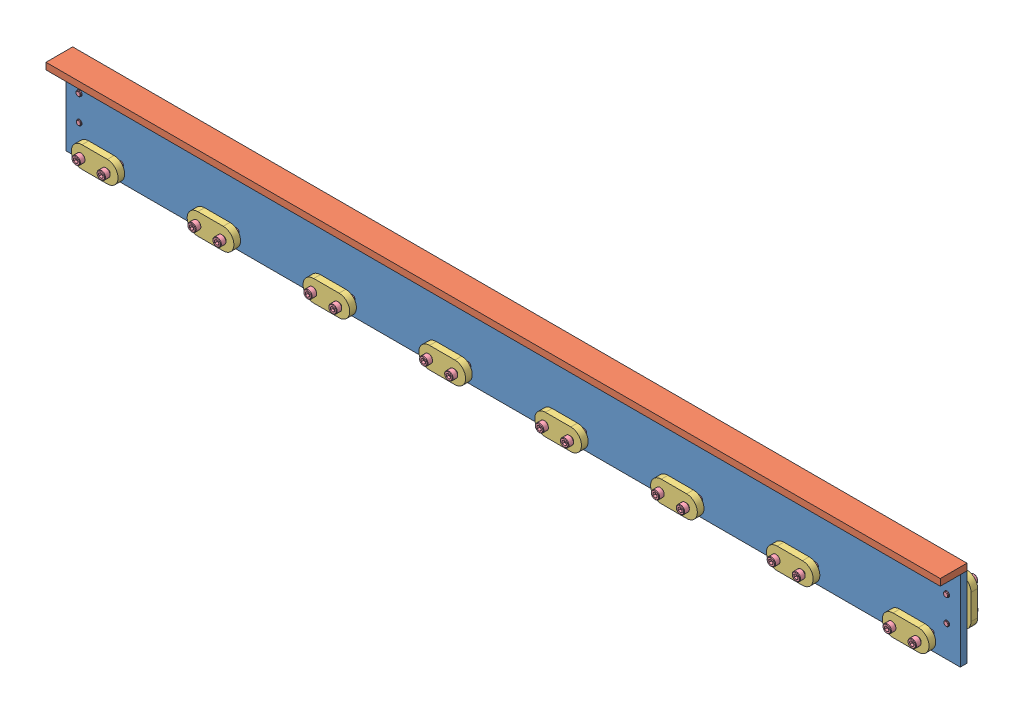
SolidWorks assembly fs-bs-right-mount-assembly-with-screws.SLDASM, configuration Default (file format 9000). Lengths in mm.
Overall size (850.9 82.55 45.12).
33 component instances, 4 part files, 6 mates.
Components (placement in the parent):
- fs-bs-right-mount-assembly-1: fs-bs-right-mount-assembly.SLDASM [Default] at origin size (850.9 82.55 38.15)
  - fs-bs-right-mount-vertical-component-1: fs-bs-right-mount-vertical-component.SLDPRT [Default] at origin size (850.9 76.2 6.35)
  - fs-bs-right-mount-horizontal-component-1: fs-bs-right-mount-horizontal-component.SLDPRT [Default] at (425.45 76.2 12.7) size (850.9 6.35 25.4)
  - fs-clamp-1: fs-clamp.SLDPRT [Default] at (27.94 15.24 12.7326) size (44.45 20.32 6.35)
  - fs-clamp-11: fs-clamp.SLDPRT [Default] at (12.7 29.845 -12.7409) x (0 1 0) z (0 0 1) size (44.45 20.32 6.35)
  - fs-clamp-12: fs-clamp.SLDPRT [Default] at (838.2 29.845 -6.3972) x (0 1 0) z (0 0 -1) size (44.45 20.32 6.35)
  - fs-clamp-4: fs-clamp.SLDPRT [Default] at (138.176 15.24 12.7326) size (44.45 20.32 6.35)
  - fs-clamp-5: fs-clamp.SLDPRT [Default] at (248.412 15.24 12.7326) size (44.45 20.32 6.35)
  - fs-clamp-6: fs-clamp.SLDPRT [Default] at (358.648 15.24 12.7326) size (44.45 20.32 6.35)
  - fs-clamp-7: fs-clamp.SLDPRT [Default] at (468.884 15.24 12.7326) size (44.45 20.32 6.35)
  - fs-clamp-8: fs-clamp.SLDPRT [Default] at (579.12 15.24 12.7326) size (44.45 20.32 6.35)
  - fs-clamp-9: fs-clamp.SLDPRT [Default] at (689.356 15.24 12.7326) size (44.45 20.32 6.35)
  - fs-clamp-10: fs-clamp.SLDPRT [Default] at (799.592 15.24 12.7326) size (44.45 20.32 6.35)
- socket head cap screw_ai-1: socket head cap screw_ai.sldprt [HX-SHCS 0.19-32x0.875x0.875-N] at (52.07 15.24 25.3347) x (0 0 -1) z (0.61191 -0.790927 0) size (27.05 7.94 7.94)
- socket head cap screw_ai-2: socket head cap screw_ai.sldprt [HX-SHCS 0.19-32x0.875x0.875-N] at (12.7 29.845 -19.6757) x (0 0 1) z (-0.841681 -0.539975 0) size (27.05 7.94 7.94)
- socket head cap screw_ai-3: socket head cap screw_ai.sldprt [HX-SHCS 0.19-32x0.875x0.875-N] at (12.7 53.975 -19.387) x (0 0 1) z (0.231262 0.972891 0) size (27.05 7.94 7.94)
- socket head cap screw_ai-4: socket head cap screw_ai.sldprt [HX-SHCS 0.19-32x0.875x0.875-N] at (838.2 29.845 -19.7235) x (0 0 1) z (-0.178736 -0.983897 0) size (27.05 7.94 7.94)
- socket head cap screw_ai-5: socket head cap screw_ai.sldprt [HX-SHCS 0.19-32x0.875x0.875-N] at (838.2 53.975 -19.4006) x (0 0 1) z (-0.954871 -0.29702 0) size (27.05 7.94 7.94)
- socket head cap screw_ai-6: socket head cap screw_ai.sldprt [HX-SHCS 0.19-32x0.875x0.875-N] at (27.94 15.24 25.0524) x (0 0 -1) z (-0.570283 0.821448 0) size (27.05 7.94 7.94)
- socket head cap screw_ai-7: socket head cap screw_ai.sldprt [HX-SHCS 0.19-32x0.875x0.875-N] at (138.176 15.24 25.0524) x (0 0 -1) z (-0.570283 0.821448 0) size (27.05 7.94 7.94)
- socket head cap screw_ai-8: socket head cap screw_ai.sldprt [HX-SHCS 0.19-32x0.875x0.875-N] at (248.412 15.24 25.0524) x (0 0 -1) z (-0.570283 0.821448 0) size (27.05 7.94 7.94)
- socket head cap screw_ai-9: socket head cap screw_ai.sldprt [HX-SHCS 0.19-32x0.875x0.875-N] at (358.648 15.24 25.0524) x (0 0 -1) z (-0.570283 0.821448 0) size (27.05 7.94 7.94)
- socket head cap screw_ai-10: socket head cap screw_ai.sldprt [HX-SHCS 0.19-32x0.875x0.875-N] at (468.884 15.24 25.0524) x (0 0 -1) z (-0.570283 0.821448 0) size (27.05 7.94 7.94)
- socket head cap screw_ai-11: socket head cap screw_ai.sldprt [HX-SHCS 0.19-32x0.875x0.875-N] at (579.12 15.24 25.0524) x (0 0 -1) z (-0.570283 0.821448 0) size (27.05 7.94 7.94)
- socket head cap screw_ai-12: socket head cap screw_ai.sldprt [HX-SHCS 0.19-32x0.875x0.875-N] at (689.356 15.24 25.0524) x (0 0 -1) z (-0.570283 0.821448 0) size (27.05 7.94 7.94)
- socket head cap screw_ai-13: socket head cap screw_ai.sldprt [HX-SHCS 0.19-32x0.875x0.875-N] at (799.592 15.24 25.0524) x (0 0 -1) z (-0.570283 0.821448 0) size (27.05 7.94 7.94)
- socket head cap screw_ai-14: socket head cap screw_ai.sldprt [HX-SHCS 0.19-32x0.875x0.875-N] at (162.306 15.24 25.3347) x (0 0 -1) z (0.61191 -0.790927 0) size (27.05 7.94 7.94)
- socket head cap screw_ai-15: socket head cap screw_ai.sldprt [HX-SHCS 0.19-32x0.875x0.875-N] at (272.542 15.24 25.3347) x (0 0 -1) z (0.61191 -0.790927 0) size (27.05 7.94 7.94)
- socket head cap screw_ai-16: socket head cap screw_ai.sldprt [HX-SHCS 0.19-32x0.875x0.875-N] at (382.778 15.24 25.3347) x (0 0 -1) z (0.61191 -0.790927 0) size (27.05 7.94 7.94)
- socket head cap screw_ai-17: socket head cap screw_ai.sldprt [HX-SHCS 0.19-32x0.875x0.875-N] at (493.014 15.24 25.3347) x (0 0 -1) z (0.61191 -0.790927 0) size (27.05 7.94 7.94)
- socket head cap screw_ai-18: socket head cap screw_ai.sldprt [HX-SHCS 0.19-32x0.875x0.875-N] at (603.25 15.24 25.3347) x (0 0 -1) z (0.61191 -0.790927 0) size (27.05 7.94 7.94)
- socket head cap screw_ai-19: socket head cap screw_ai.sldprt [HX-SHCS 0.19-32x0.875x0.875-N] at (713.486 15.24 25.3347) x (0 0 -1) z (0.61191 -0.790927 0) size (27.05 7.94 7.94)
- socket head cap screw_ai-20: socket head cap screw_ai.sldprt [HX-SHCS 0.19-32x0.875x0.875-N] at (823.722 15.24 25.3347) x (0 0 -1) z (0.61191 -0.790927 0) size (27.05 7.94 7.94)
Mates (geometry in assembly coordinates):
- Concentric1: concentric aligned: cylinder of fs-bs-right-mount-assembly-1/fs-clamp-11 through (12.7 29.845 -6.3909) axis (0 0 -1) radius 2.54; cylinder of socket head cap screw_ai-2 through (12.7 29.845 -51.4257) axis (0 0 -1) radius 2.413
- Concentric2: concentric aligned: cylinder of fs-bs-right-mount-assembly-1/fs-clamp-11 through (12.7 53.975 -6.3909) axis (0 0 -1) radius 2.54; cylinder of socket head cap screw_ai-3 through (12.7 53.975 -51.137) axis (0 0 -1) radius 2.413
- Concentric3: concentric anti-aligned: cylinder of fs-bs-right-mount-assembly-1/fs-clamp-1 through (27.94 15.24 19.0826) axis (0 0 -1) radius 2.54; cylinder of socket head cap screw_ai-6 through (27.94 15.24 56.8024) axis (0 0 1) radius 2.413
- Concentric4: concentric anti-aligned: cylinder of fs-bs-right-mount-assembly-1/fs-clamp-1 through (52.07 15.24 19.0826) axis (0 0 -1) radius 2.54; cylinder of socket head cap screw_ai-1 through (52.07 15.24 57.0847) axis (0 0 1) radius 2.413
- Concentric5: concentric anti-aligned: cylinder of fs-bs-right-mount-assembly-1/fs-clamp-12 through (838.2 53.975 -12.7472) axis (0 0 1) radius 2.54; cylinder of socket head cap screw_ai-5 through (838.2 53.975 -51.1506) axis (0 0 -1) radius 2.413
- Concentric6: concentric anti-aligned: cylinder of fs-bs-right-mount-assembly-1/fs-clamp-12 through (838.2 29.845 -12.7472) axis (0 0 1) radius 2.54; cylinder of socket head cap screw_ai-4 through (838.2 29.845 -51.4735) axis (0 0 -1) radius 2.413
